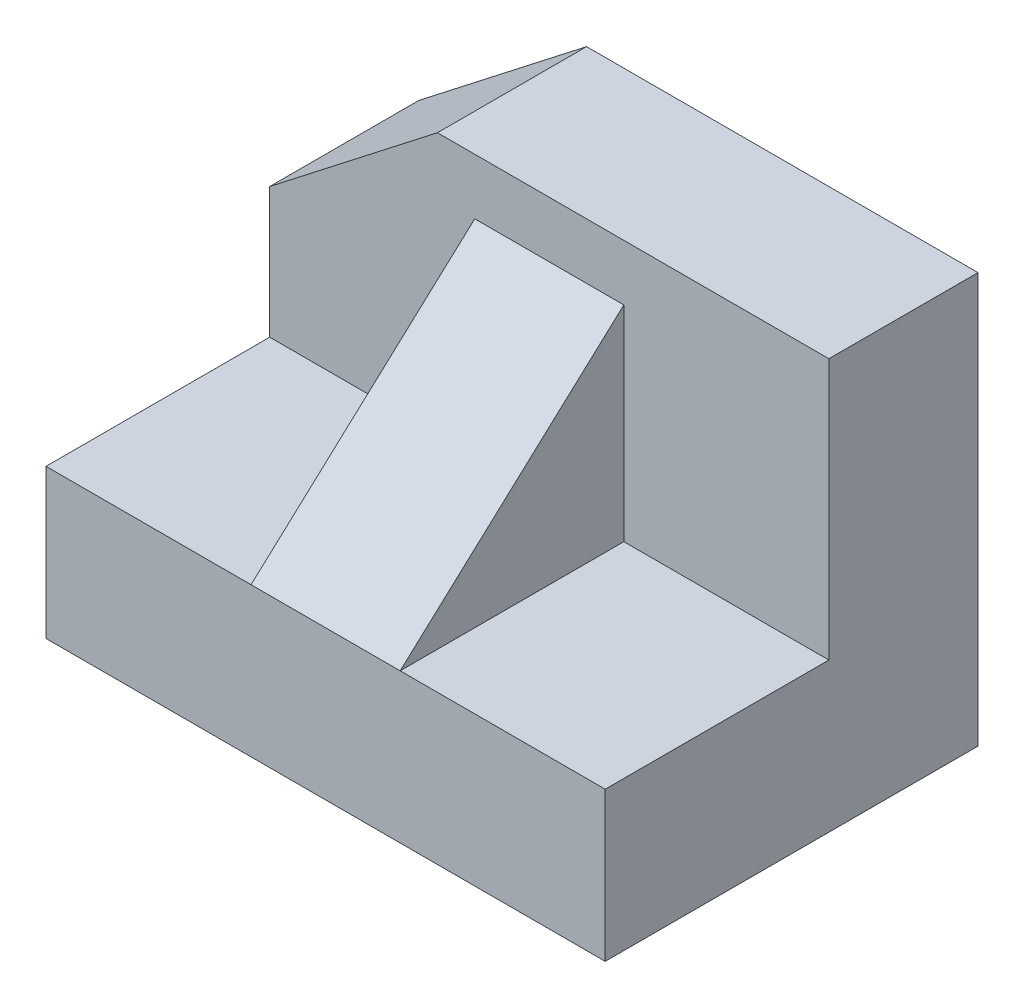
ISO-10303-21;
HEADER;
FILE_DESCRIPTION(('STEP AP214'),'2;1');
FILE_NAME('part.step','',(''),(''),'','','');
FILE_SCHEMA(('AUTOMOTIVE_DESIGN { 1 0 10303 214 1 1 1 1 }'));
ENDSEC;
DATA;
#1=APPLICATION_CONTEXT('core data for automotive mechanical design processes');
#2=APPLICATION_PROTOCOL_DEFINITION('international standard','automotive_design',2000,#1);
#3=PRODUCT_CONTEXT('',#1,'mechanical');
#4=PRODUCT('Part','Part','',(#3));
#5=PRODUCT_RELATED_PRODUCT_CATEGORY('part','',(#4));
#6=PRODUCT_DEFINITION_FORMATION('','',#4);
#7=PRODUCT_DEFINITION_CONTEXT('part definition',#1,'design');
#8=PRODUCT_DEFINITION('design','',#6,#7);
#9=PRODUCT_DEFINITION_SHAPE('','',#8);
#10=(LENGTH_UNIT() NAMED_UNIT(*) SI_UNIT(.MILLI.,.METRE.));
#11=(NAMED_UNIT(*) PLANE_ANGLE_UNIT() SI_UNIT($,.RADIAN.));
#12=(NAMED_UNIT(*) SI_UNIT($,.STERADIAN.) SOLID_ANGLE_UNIT());
#13=UNCERTAINTY_MEASURE_WITH_UNIT(LENGTH_MEASURE(1.E-05),#10,'distance_accuracy_value','');
#14=(GEOMETRIC_REPRESENTATION_CONTEXT(3) GLOBAL_UNCERTAINTY_ASSIGNED_CONTEXT((#13)) GLOBAL_UNIT_ASSIGNED_CONTEXT((#10,
#11,#12)) REPRESENTATION_CONTEXT('',''));
#15=CARTESIAN_POINT('',(0.,0.,0.));
#16=DIRECTION('',(0.,0.,1.));
#17=DIRECTION('',(1.,0.,0.));
#18=AXIS2_PLACEMENT_3D('',#15,#16,#17);
#19=CARTESIAN_POINT('',(0.,8.,-20.));
#20=DIRECTION('',(0.,-1.,0.));
#21=DIRECTION('',(0.,0.,-1.));
#22=AXIS2_PLACEMENT_3D('',#19,#20,#21);
#23=PLANE('',#22);
#24=DIRECTION('',(0.,0.,-1.));
#25=VECTOR('',#24,1.);
#26=CARTESIAN_POINT('',(19.,8.,0.));
#27=LINE('',#26,#25);
#28=CARTESIAN_POINT('',(19.,8.,0.));
#29=VERTEX_POINT('',#28);
#30=CARTESIAN_POINT('',(19.,8.,-12.));
#31=VERTEX_POINT('',#30);
#32=EDGE_CURVE('E141',#29,#31,#27,.T.);
#33=ORIENTED_EDGE('',*,*,#32,.F.);
#34=DIRECTION('',(1.,0.,0.));
#35=VECTOR('',#34,1.);
#36=CARTESIAN_POINT('',(0.,8.,0.));
#37=LINE('',#36,#35);
#38=CARTESIAN_POINT('',(30.,8.,0.));
#39=VERTEX_POINT('',#38);
#40=EDGE_CURVE('E198',#29,#39,#37,.T.);
#41=ORIENTED_EDGE('',*,*,#40,.T.);
#42=DIRECTION('',(0.,0.,-1.));
#43=VECTOR('',#42,1.);
#44=CARTESIAN_POINT('',(30.,8.,0.));
#45=LINE('',#44,#43);
#46=CARTESIAN_POINT('',(30.,8.,-12.));
#47=VERTEX_POINT('',#46);
#48=EDGE_CURVE('E191',#39,#47,#45,.T.);
#49=ORIENTED_EDGE('',*,*,#48,.T.);
#50=DIRECTION('',(1.,0.,0.));
#51=VECTOR('',#50,1.);
#52=CARTESIAN_POINT('',(0.,8.,-12.));
#53=LINE('',#52,#51);
#54=EDGE_CURVE('E151',#31,#47,#53,.T.);
#55=ORIENTED_EDGE('',*,*,#54,.F.);
#56=EDGE_LOOP('',(#33,#41,#49,#55));
#57=FACE_BOUND('',#56,.T.);
#58=ADVANCED_FACE('F31',(#57),#23,.F.);
#59=CARTESIAN_POINT('',(0.,22.,-12.));
#60=DIRECTION('',(0.,0.,-1.));
#61=DIRECTION('',(-1.,0.,0.));
#62=AXIS2_PLACEMENT_3D('',#59,#60,#61);
#63=PLANE('',#62);
#64=DIRECTION('',(1.,0.,0.));
#65=VECTOR('',#64,1.);
#66=CARTESIAN_POINT('',(0.,22.,-12.));
#67=LINE('',#66,#65);
#68=CARTESIAN_POINT('',(9.,22.,-12.));
#69=VERTEX_POINT('',#68);
#70=CARTESIAN_POINT('',(30.,22.,-12.));
#71=VERTEX_POINT('',#70);
#72=EDGE_CURVE('E152',#69,#71,#67,.T.);
#73=ORIENTED_EDGE('',*,*,#72,.F.);
#74=DIRECTION('',(-0.789352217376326,-0.61394061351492,0.));
#75=VECTOR('',#74,1.);
#76=CARTESIAN_POINT('',(3.39230769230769,17.6384615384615,-12.));
#77=LINE('',#76,#75);
#78=CARTESIAN_POINT('',(0.,15.,-12.));
#79=VERTEX_POINT('',#78);
#80=EDGE_CURVE('E48',#69,#79,#77,.T.);
#81=ORIENTED_EDGE('',*,*,#80,.T.);
#82=DIRECTION('',(0.,-1.,0.));
#83=VECTOR('',#82,1.);
#84=CARTESIAN_POINT('',(0.,22.,-12.));
#85=LINE('',#84,#83);
#86=CARTESIAN_POINT('',(0.,8.,-12.));
#87=VERTEX_POINT('',#86);
#88=EDGE_CURVE('E35',#79,#87,#85,.T.);
#89=ORIENTED_EDGE('',*,*,#88,.T.);
#90=CARTESIAN_POINT('',(11.,8.,-12.));
#91=VERTEX_POINT('',#90);
#92=EDGE_CURVE('E154',#87,#91,#53,.T.);
#93=ORIENTED_EDGE('',*,*,#92,.T.);
#94=DIRECTION('',(0.,1.,0.));
#95=VECTOR('',#94,1.);
#96=CARTESIAN_POINT('',(11.,8.,-12.));
#97=LINE('',#96,#95);
#98=CARTESIAN_POINT('',(11.,19.,-12.));
#99=VERTEX_POINT('',#98);
#100=EDGE_CURVE('E128',#91,#99,#97,.T.);
#101=ORIENTED_EDGE('',*,*,#100,.T.);
#102=DIRECTION('',(-1.,0.,0.));
#103=VECTOR('',#102,1.);
#104=CARTESIAN_POINT('',(19.,19.,-12.));
#105=LINE('',#104,#103);
#106=CARTESIAN_POINT('',(19.,19.,-12.));
#107=VERTEX_POINT('',#106);
#108=EDGE_CURVE('E149',#107,#99,#105,.T.);
#109=ORIENTED_EDGE('',*,*,#108,.F.);
#110=DIRECTION('',(0.,1.,0.));
#111=VECTOR('',#110,1.);
#112=CARTESIAN_POINT('',(19.,8.,-12.));
#113=LINE('',#112,#111);
#114=EDGE_CURVE('E135',#31,#107,#113,.T.);
#115=ORIENTED_EDGE('',*,*,#114,.F.);
#116=ORIENTED_EDGE('',*,*,#54,.T.);
#117=DIRECTION('',(0.,-1.,0.));
#118=VECTOR('',#117,1.);
#119=CARTESIAN_POINT('',(30.,22.,-12.));
#120=LINE('',#119,#118);
#121=EDGE_CURVE('E118',#71,#47,#120,.T.);
#122=ORIENTED_EDGE('',*,*,#121,.F.);
#123=EDGE_LOOP('',(#73,#81,#89,#93,#101,#109,#115,#116,#122));
#124=FACE_BOUND('',#123,.T.);
#125=ADVANCED_FACE('F222',(#124),#63,.F.);
#126=CARTESIAN_POINT('',(0.,8.,0.));
#127=VERTEX_POINT('',#126);
#128=CARTESIAN_POINT('',(11.,8.,0.));
#129=VERTEX_POINT('',#128);
#130=EDGE_CURVE('E200',#127,#129,#37,.T.);
#131=ORIENTED_EDGE('',*,*,#130,.T.);
#132=DIRECTION('',(0.,0.,-1.));
#133=VECTOR('',#132,1.);
#134=CARTESIAN_POINT('',(11.,8.,0.));
#135=LINE('',#134,#133);
#136=EDGE_CURVE('E139',#129,#91,#135,.T.);
#137=ORIENTED_EDGE('',*,*,#136,.T.);
#138=ORIENTED_EDGE('',*,*,#92,.F.);
#139=DIRECTION('',(0.,0.,1.));
#140=VECTOR('',#139,1.);
#141=CARTESIAN_POINT('',(0.,8.,0.));
#142=LINE('',#141,#140);
#143=EDGE_CURVE('E188',#87,#127,#142,.T.);
#144=ORIENTED_EDGE('',*,*,#143,.T.);
#145=EDGE_LOOP('',(#131,#137,#138,#144));
#146=FACE_BOUND('',#145,.T.);
#147=ADVANCED_FACE('F224',(#146),#23,.F.);
#148=CARTESIAN_POINT('',(0.,8.,0.));
#149=DIRECTION('',(1.,0.,0.));
#150=DIRECTION('',(0.,0.,-1.));
#151=AXIS2_PLACEMENT_3D('',#148,#149,#150);
#152=PLANE('',#151);
#153=ORIENTED_EDGE('',*,*,#88,.F.);
#154=DIRECTION('',(0.,0.,-1.));
#155=VECTOR('',#154,1.);
#156=CARTESIAN_POINT('',(0.,15.,55.7969000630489));
#157=LINE('',#156,#155);
#158=CARTESIAN_POINT('',(0.,15.,-20.));
#159=VERTEX_POINT('',#158);
#160=EDGE_CURVE('E55',#79,#159,#157,.T.);
#161=ORIENTED_EDGE('',*,*,#160,.T.);
#162=DIRECTION('',(0.,-1.,0.));
#163=VECTOR('',#162,1.);
#164=CARTESIAN_POINT('',(0.,8.,-20.));
#165=LINE('',#164,#163);
#166=CARTESIAN_POINT('',(0.,0.,-20.));
#167=VERTEX_POINT('',#166);
#168=EDGE_CURVE('E124',#159,#167,#165,.T.);
#169=ORIENTED_EDGE('',*,*,#168,.T.);
#170=DIRECTION('',(0.,0.,1.));
#171=VECTOR('',#170,1.);
#172=CARTESIAN_POINT('',(0.,0.,0.));
#173=LINE('',#172,#171);
#174=CARTESIAN_POINT('',(0.,0.,0.));
#175=VERTEX_POINT('',#174);
#176=EDGE_CURVE('E172',#167,#175,#173,.T.);
#177=ORIENTED_EDGE('',*,*,#176,.T.);
#178=DIRECTION('',(0.,-1.,0.));
#179=VECTOR('',#178,1.);
#180=CARTESIAN_POINT('',(0.,8.,0.));
#181=LINE('',#180,#179);
#182=EDGE_CURVE('E41',#127,#175,#181,.T.);
#183=ORIENTED_EDGE('',*,*,#182,.F.);
#184=ORIENTED_EDGE('',*,*,#143,.F.);
#185=EDGE_LOOP('',(#153,#161,#169,#177,#183,#184));
#186=FACE_BOUND('',#185,.T.);
#187=ADVANCED_FACE('F33',(#186),#152,.F.);
#188=CARTESIAN_POINT('',(0.,8.,0.));
#189=DIRECTION('',(0.,0.,-1.));
#190=DIRECTION('',(-1.,0.,0.));
#191=AXIS2_PLACEMENT_3D('',#188,#189,#190);
#192=PLANE('',#191);
#193=DIRECTION('',(1.,0.,0.));
#194=VECTOR('',#193,1.);
#195=CARTESIAN_POINT('',(0.,0.,0.));
#196=LINE('',#195,#194);
#197=CARTESIAN_POINT('',(30.,0.,0.));
#198=VERTEX_POINT('',#197);
#199=EDGE_CURVE('E176',#175,#198,#196,.T.);
#200=ORIENTED_EDGE('',*,*,#199,.T.);
#201=DIRECTION('',(0.,-1.,0.));
#202=VECTOR('',#201,1.);
#203=CARTESIAN_POINT('',(30.,8.,0.));
#204=LINE('',#203,#202);
#205=EDGE_CURVE('E193',#39,#198,#204,.T.);
#206=ORIENTED_EDGE('',*,*,#205,.F.);
#207=ORIENTED_EDGE('',*,*,#40,.F.);
#208=DIRECTION('',(-1.,0.,0.));
#209=VECTOR('',#208,1.);
#210=CARTESIAN_POINT('',(19.,8.,0.));
#211=LINE('',#210,#209);
#212=EDGE_CURVE('E142',#29,#129,#211,.T.);
#213=ORIENTED_EDGE('',*,*,#212,.T.);
#214=ORIENTED_EDGE('',*,*,#130,.F.);
#215=ORIENTED_EDGE('',*,*,#182,.T.);
#216=EDGE_LOOP('',(#200,#206,#207,#213,#214,#215));
#217=FACE_BOUND('',#216,.T.);
#218=ADVANCED_FACE('F210',(#217),#192,.F.);
#219=CARTESIAN_POINT('',(30.,8.,0.));
#220=DIRECTION('',(-1.,0.,0.));
#221=DIRECTION('',(0.,0.,1.));
#222=AXIS2_PLACEMENT_3D('',#219,#220,#221);
#223=PLANE('',#222);
#224=DIRECTION('',(0.,0.,-1.));
#225=VECTOR('',#224,1.);
#226=CARTESIAN_POINT('',(30.,0.,0.));
#227=LINE('',#226,#225);
#228=CARTESIAN_POINT('',(30.,0.,-20.));
#229=VERTEX_POINT('',#228);
#230=EDGE_CURVE('E180',#198,#229,#227,.T.);
#231=ORIENTED_EDGE('',*,*,#230,.T.);
#232=DIRECTION('',(0.,-1.,0.));
#233=VECTOR('',#232,1.);
#234=CARTESIAN_POINT('',(30.,8.,-20.));
#235=LINE('',#234,#233);
#236=CARTESIAN_POINT('',(30.,22.,-20.));
#237=VERTEX_POINT('',#236);
#238=EDGE_CURVE('E190',#237,#229,#235,.T.);
#239=ORIENTED_EDGE('',*,*,#238,.F.);
#240=DIRECTION('',(0.,0.,-1.));
#241=VECTOR('',#240,1.);
#242=CARTESIAN_POINT('',(30.,22.,-20.));
#243=LINE('',#242,#241);
#244=EDGE_CURVE('E115',#71,#237,#243,.T.);
#245=ORIENTED_EDGE('',*,*,#244,.F.);
#246=ORIENTED_EDGE('',*,*,#121,.T.);
#247=ORIENTED_EDGE('',*,*,#48,.F.);
#248=ORIENTED_EDGE('',*,*,#205,.T.);
#249=EDGE_LOOP('',(#231,#239,#245,#246,#247,#248));
#250=FACE_BOUND('',#249,.T.);
#251=ADVANCED_FACE('F212',(#250),#223,.F.);
#252=CARTESIAN_POINT('',(0.,8.,-20.));
#253=DIRECTION('',(0.,0.,1.));
#254=DIRECTION('',(1.,0.,0.));
#255=AXIS2_PLACEMENT_3D('',#252,#253,#254);
#256=PLANE('',#255);
#257=ORIENTED_EDGE('',*,*,#168,.F.);
#258=DIRECTION('',(0.789352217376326,0.61394061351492,0.));
#259=VECTOR('',#258,1.);
#260=CARTESIAN_POINT('',(-3.39230769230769,12.3615384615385,-20.));
#261=LINE('',#260,#259);
#262=CARTESIAN_POINT('',(9.,22.,-20.));
#263=VERTEX_POINT('',#262);
#264=EDGE_CURVE('E121',#159,#263,#261,.T.);
#265=ORIENTED_EDGE('',*,*,#264,.T.);
#266=DIRECTION('',(-1.,0.,0.));
#267=VECTOR('',#266,1.);
#268=CARTESIAN_POINT('',(0.,22.,-20.));
#269=LINE('',#268,#267);
#270=EDGE_CURVE('E111',#237,#263,#269,.T.);
#271=ORIENTED_EDGE('',*,*,#270,.F.);
#272=ORIENTED_EDGE('',*,*,#238,.T.);
#273=DIRECTION('',(-1.,0.,0.));
#274=VECTOR('',#273,1.);
#275=CARTESIAN_POINT('',(0.,0.,-20.));
#276=LINE('',#275,#274);
#277=EDGE_CURVE('E186',#229,#167,#276,.T.);
#278=ORIENTED_EDGE('',*,*,#277,.T.);
#279=EDGE_LOOP('',(#257,#265,#271,#272,#278));
#280=FACE_BOUND('',#279,.T.);
#281=ADVANCED_FACE('F122',(#280),#256,.F.);
#282=CARTESIAN_POINT('',(0.,0.,-20.));
#283=DIRECTION('',(0.,-1.,0.));
#284=DIRECTION('',(0.,0.,-1.));
#285=AXIS2_PLACEMENT_3D('',#282,#283,#284);
#286=PLANE('',#285);
#287=ORIENTED_EDGE('',*,*,#176,.F.);
#288=ORIENTED_EDGE('',*,*,#277,.F.);
#289=ORIENTED_EDGE('',*,*,#230,.F.);
#290=ORIENTED_EDGE('',*,*,#199,.F.);
#291=EDGE_LOOP('',(#287,#288,#289,#290));
#292=FACE_BOUND('',#291,.T.);
#293=ADVANCED_FACE('F219',(#292),#286,.T.);
#294=CARTESIAN_POINT('',(0.,22.,-12.));
#295=DIRECTION('',(0.,1.,0.));
#296=DIRECTION('',(0.,0.,1.));
#297=AXIS2_PLACEMENT_3D('',#294,#295,#296);
#298=PLANE('',#297);
#299=DIRECTION('',(0.,0.,-1.));
#300=VECTOR('',#299,1.);
#301=CARTESIAN_POINT('',(9.,22.,-12.));
#302=LINE('',#301,#300);
#303=EDGE_CURVE('E11',#69,#263,#302,.T.);
#304=ORIENTED_EDGE('',*,*,#303,.F.);
#305=ORIENTED_EDGE('',*,*,#72,.T.);
#306=ORIENTED_EDGE('',*,*,#244,.T.);
#307=ORIENTED_EDGE('',*,*,#270,.T.);
#308=EDGE_LOOP('',(#304,#305,#306,#307));
#309=FACE_BOUND('',#308,.T.);
#310=ADVANCED_FACE('F113',(#309),#298,.T.);
#311=CARTESIAN_POINT('',(19.,19.,-12.));
#312=DIRECTION('',(0.,-0.737154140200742,-0.675724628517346));
#313=DIRECTION('',(0.,0.675724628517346,-0.737154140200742));
#314=AXIS2_PLACEMENT_3D('',#311,#312,#313);
#315=PLANE('',#314);
#316=DIRECTION('',(0.,-0.675724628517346,0.737154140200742));
#317=VECTOR('',#316,1.);
#318=CARTESIAN_POINT('',(11.,19.,-12.));
#319=LINE('',#318,#317);
#320=EDGE_CURVE('E131',#99,#129,#319,.T.);
#321=ORIENTED_EDGE('',*,*,#320,.T.);
#322=ORIENTED_EDGE('',*,*,#212,.F.);
#323=DIRECTION('',(0.,-0.675724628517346,0.737154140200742));
#324=VECTOR('',#323,1.);
#325=CARTESIAN_POINT('',(19.,19.,-12.));
#326=LINE('',#325,#324);
#327=EDGE_CURVE('E138',#107,#29,#326,.T.);
#328=ORIENTED_EDGE('',*,*,#327,.F.);
#329=ORIENTED_EDGE('',*,*,#108,.T.);
#330=EDGE_LOOP('',(#321,#322,#328,#329));
#331=FACE_BOUND('',#330,.T.);
#332=ADVANCED_FACE('F239',(#331),#315,.F.);
#333=CARTESIAN_POINT('',(19.,8.,-12.));
#334=DIRECTION('',(-1.,0.,0.));
#335=DIRECTION('',(0.,0.,1.));
#336=AXIS2_PLACEMENT_3D('',#333,#334,#335);
#337=PLANE('',#336);
#338=ORIENTED_EDGE('',*,*,#114,.T.);
#339=ORIENTED_EDGE('',*,*,#327,.T.);
#340=ORIENTED_EDGE('',*,*,#32,.T.);
#341=EDGE_LOOP('',(#338,#339,#340));
#342=FACE_BOUND('',#341,.T.);
#343=ADVANCED_FACE('F247',(#342),#337,.F.);
#344=CARTESIAN_POINT('',(11.,8.,-12.));
#345=DIRECTION('',(-1.,0.,0.));
#346=DIRECTION('',(0.,0.,1.));
#347=AXIS2_PLACEMENT_3D('',#344,#345,#346);
#348=PLANE('',#347);
#349=ORIENTED_EDGE('',*,*,#100,.F.);
#350=ORIENTED_EDGE('',*,*,#136,.F.);
#351=ORIENTED_EDGE('',*,*,#320,.F.);
#352=EDGE_LOOP('',(#349,#350,#351));
#353=FACE_BOUND('',#352,.T.);
#354=ADVANCED_FACE('F244',(#353),#348,.T.);
#355=CARTESIAN_POINT('',(9.,22.,55.7969000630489));
#356=DIRECTION('',(0.61394061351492,-0.789352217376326,0.));
#357=DIRECTION('',(0.789352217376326,0.61394061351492,0.));
#358=AXIS2_PLACEMENT_3D('',#355,#356,#357);
#359=PLANE('',#358);
#360=ORIENTED_EDGE('',*,*,#80,.F.);
#361=ORIENTED_EDGE('',*,*,#303,.T.);
#362=ORIENTED_EDGE('',*,*,#264,.F.);
#363=ORIENTED_EDGE('',*,*,#160,.F.);
#364=EDGE_LOOP('',(#360,#361,#362,#363));
#365=FACE_BOUND('',#364,.T.);
#366=ADVANCED_FACE('F127',(#365),#359,.F.);
#367=CLOSED_SHELL('',(#58,#125,#147,#187,#218,#251,#281,#293,#310,#332,#343,#354,#366));
#368=MANIFOLD_SOLID_BREP('B2',#367);
#369=ADVANCED_BREP_SHAPE_REPRESENTATION('',(#18,#368),#14);
#370=SHAPE_DEFINITION_REPRESENTATION(#9,#369);
ENDSEC;
END-ISO-10303-21;
